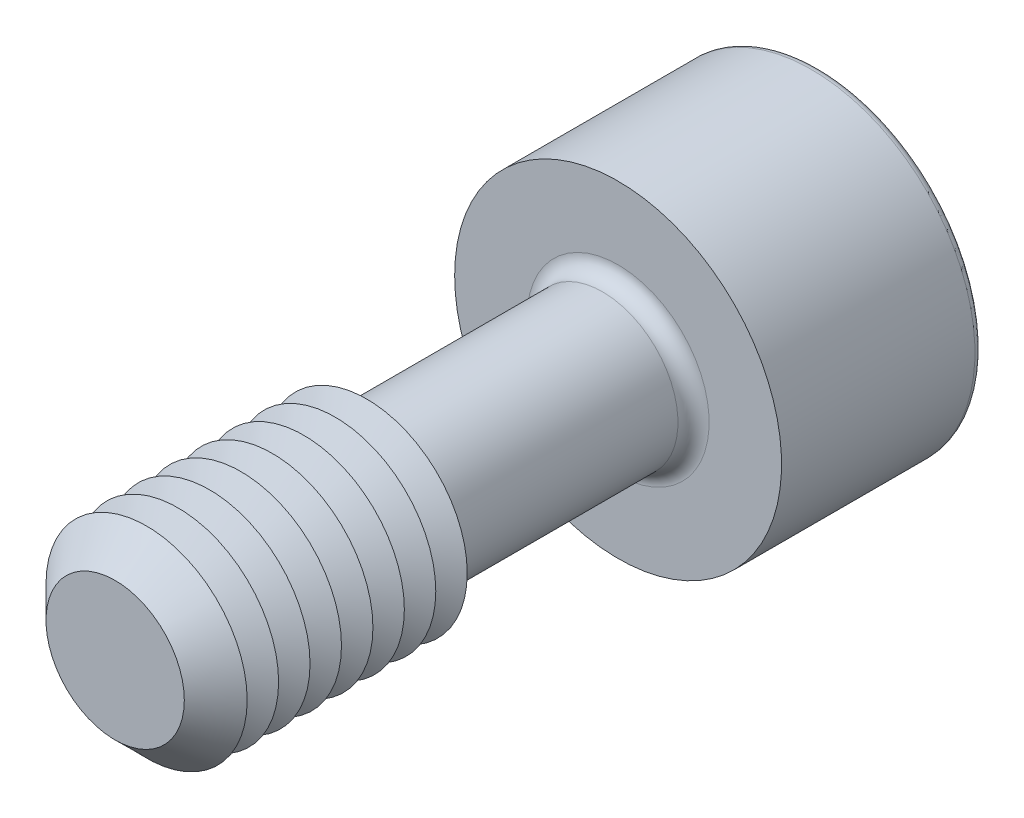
ISO-10303-21;
HEADER;
FILE_DESCRIPTION(('STEP AP214'),'2;1');
FILE_NAME('part.step','',(''),(''),'','','');
FILE_SCHEMA(('AUTOMOTIVE_DESIGN { 1 0 10303 214 1 1 1 1 }'));
ENDSEC;
DATA;
#1=APPLICATION_CONTEXT('core data for automotive mechanical design processes');
#2=APPLICATION_PROTOCOL_DEFINITION('international standard','automotive_design',2000,#1);
#3=PRODUCT_CONTEXT('',#1,'mechanical');
#4=PRODUCT('Part','Part','',(#3));
#5=PRODUCT_RELATED_PRODUCT_CATEGORY('part','',(#4));
#6=PRODUCT_DEFINITION_FORMATION('','',#4);
#7=PRODUCT_DEFINITION_CONTEXT('part definition',#1,'design');
#8=PRODUCT_DEFINITION('design','',#6,#7);
#9=PRODUCT_DEFINITION_SHAPE('','',#8);
#10=(LENGTH_UNIT() NAMED_UNIT(*) SI_UNIT(.MILLI.,.METRE.));
#11=(NAMED_UNIT(*) PLANE_ANGLE_UNIT() SI_UNIT($,.RADIAN.));
#12=(NAMED_UNIT(*) SI_UNIT($,.STERADIAN.) SOLID_ANGLE_UNIT());
#13=UNCERTAINTY_MEASURE_WITH_UNIT(LENGTH_MEASURE(1.E-05),#10,'distance_accuracy_value','');
#14=(GEOMETRIC_REPRESENTATION_CONTEXT(3) GLOBAL_UNCERTAINTY_ASSIGNED_CONTEXT((#13)) GLOBAL_UNIT_ASSIGNED_CONTEXT((#10,
#11,#12)) REPRESENTATION_CONTEXT('',''));
#15=CARTESIAN_POINT('',(0.,0.,0.));
#16=DIRECTION('',(0.,0.,1.));
#17=DIRECTION('',(1.,0.,0.));
#18=AXIS2_PLACEMENT_3D('',#15,#16,#17);
#19=CARTESIAN_POINT('',(-1.73205080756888,-3.,-12.));
#20=DIRECTION('',(0.,0.,1.));
#21=DIRECTION('',(1.,0.,0.));
#22=AXIS2_PLACEMENT_3D('',#19,#20,#21);
#23=PLANE('',#22);
#24=DIRECTION('',(1.,0.,0.));
#25=VECTOR('',#24,1.);
#26=CARTESIAN_POINT('',(-1.73205080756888,-3.,-12.));
#27=LINE('',#26,#25);
#28=CARTESIAN_POINT('',(0.,-3.,-12.));
#29=VERTEX_POINT('',#28);
#30=CARTESIAN_POINT('',(1.73205080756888,-3.,-12.));
#31=VERTEX_POINT('',#30);
#32=EDGE_CURVE('E405',#29,#31,#27,.T.);
#33=ORIENTED_EDGE('',*,*,#32,.F.);
#34=CARTESIAN_POINT('',(0.,0.,-12.));
#35=DIRECTION('',(0.,0.,1.));
#36=DIRECTION('',(0.,-1.,0.));
#37=AXIS2_PLACEMENT_3D('',#34,#35,#36);
#38=CIRCLE('',#37,3.);
#39=CARTESIAN_POINT('',(2.59807621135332,-1.5,-12.));
#40=VERTEX_POINT('',#39);
#41=EDGE_CURVE('E53',#29,#40,#38,.T.);
#42=ORIENTED_EDGE('',*,*,#41,.T.);
#43=DIRECTION('',(0.5,0.866025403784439,0.));
#44=VECTOR('',#43,1.);
#45=CARTESIAN_POINT('',(1.73205080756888,-3.,-12.));
#46=LINE('',#45,#44);
#47=EDGE_CURVE('E395',#31,#40,#46,.T.);
#48=ORIENTED_EDGE('',*,*,#47,.F.);
#49=EDGE_LOOP('',(#33,#42,#48));
#50=FACE_BOUND('',#49,.T.);
#51=ADVANCED_FACE('F41',(#50),#23,.F.);
#52=CARTESIAN_POINT('',(3.46410161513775,0.,-12.));
#53=VERTEX_POINT('',#52);
#54=EDGE_CURVE('E399',#40,#53,#46,.T.);
#55=ORIENTED_EDGE('',*,*,#54,.F.);
#56=CARTESIAN_POINT('',(2.59807621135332,1.5,-12.));
#57=VERTEX_POINT('',#56);
#58=EDGE_CURVE('E11',#40,#57,#38,.T.);
#59=ORIENTED_EDGE('',*,*,#58,.T.);
#60=DIRECTION('',(-0.5,0.866025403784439,0.));
#61=VECTOR('',#60,1.);
#62=CARTESIAN_POINT('',(3.46410161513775,0.,-12.));
#63=LINE('',#62,#61);
#64=EDGE_CURVE('E391',#53,#57,#63,.T.);
#65=ORIENTED_EDGE('',*,*,#64,.F.);
#66=EDGE_LOOP('',(#55,#59,#65));
#67=FACE_BOUND('',#66,.T.);
#68=ADVANCED_FACE('F133',(#67),#23,.F.);
#69=CARTESIAN_POINT('',(1.73205080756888,3.,-12.));
#70=VERTEX_POINT('',#69);
#71=EDGE_CURVE('E390',#57,#70,#63,.T.);
#72=ORIENTED_EDGE('',*,*,#71,.F.);
#73=CARTESIAN_POINT('',(0.,3.,-12.));
#74=VERTEX_POINT('',#73);
#75=EDGE_CURVE('E51',#57,#74,#38,.T.);
#76=ORIENTED_EDGE('',*,*,#75,.T.);
#77=DIRECTION('',(-1.,0.,0.));
#78=VECTOR('',#77,1.);
#79=CARTESIAN_POINT('',(1.73205080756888,3.,-12.));
#80=LINE('',#79,#78);
#81=EDGE_CURVE('E177',#70,#74,#80,.T.);
#82=ORIENTED_EDGE('',*,*,#81,.F.);
#83=EDGE_LOOP('',(#72,#76,#82));
#84=FACE_BOUND('',#83,.T.);
#85=ADVANCED_FACE('F139',(#84),#23,.F.);
#86=CARTESIAN_POINT('',(-1.73205080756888,3.,-12.));
#87=VERTEX_POINT('',#86);
#88=EDGE_CURVE('E397',#74,#87,#80,.T.);
#89=ORIENTED_EDGE('',*,*,#88,.F.);
#90=CARTESIAN_POINT('',(-2.59807621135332,1.5,-12.));
#91=VERTEX_POINT('',#90);
#92=EDGE_CURVE('E266',#74,#91,#38,.T.);
#93=ORIENTED_EDGE('',*,*,#92,.T.);
#94=DIRECTION('',(-0.5,-0.866025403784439,0.));
#95=VECTOR('',#94,1.);
#96=CARTESIAN_POINT('',(-1.73205080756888,3.,-12.));
#97=LINE('',#96,#95);
#98=EDGE_CURVE('E176',#87,#91,#97,.T.);
#99=ORIENTED_EDGE('',*,*,#98,.F.);
#100=EDGE_LOOP('',(#89,#93,#99));
#101=FACE_BOUND('',#100,.T.);
#102=ADVANCED_FACE('F157',(#101),#23,.F.);
#103=CARTESIAN_POINT('',(-3.46410161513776,0.,-12.));
#104=VERTEX_POINT('',#103);
#105=EDGE_CURVE('E170',#91,#104,#97,.T.);
#106=ORIENTED_EDGE('',*,*,#105,.F.);
#107=CARTESIAN_POINT('',(-2.59807621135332,-1.5,-12.));
#108=VERTEX_POINT('',#107);
#109=EDGE_CURVE('E172',#91,#108,#38,.T.);
#110=ORIENTED_EDGE('',*,*,#109,.T.);
#111=DIRECTION('',(0.5,-0.866025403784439,0.));
#112=VECTOR('',#111,1.);
#113=CARTESIAN_POINT('',(-3.46410161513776,0.,-12.));
#114=LINE('',#113,#112);
#115=EDGE_CURVE('E174',#104,#108,#114,.T.);
#116=ORIENTED_EDGE('',*,*,#115,.F.);
#117=EDGE_LOOP('',(#106,#110,#116));
#118=FACE_BOUND('',#117,.T.);
#119=ADVANCED_FACE('F146',(#118),#23,.F.);
#120=CARTESIAN_POINT('',(0.,0.,-18.));
#121=DIRECTION('',(0.,0.,-1.));
#122=DIRECTION('',(-1.,0.,0.));
#123=AXIS2_PLACEMENT_3D('',#120,#121,#122);
#124=PLANE('',#123);
#125=CARTESIAN_POINT('',(0.,0.,-18.));
#126=DIRECTION('',(0.,0.,-1.));
#127=DIRECTION('',(-1.,0.,0.));
#128=AXIS2_PLACEMENT_3D('',#125,#126,#127);
#129=CIRCLE('',#128,6.19);
#130=CARTESIAN_POINT('',(-6.19,0.,-18.));
#131=VERTEX_POINT('',#130);
#132=EDGE_CURVE('E250',#131,#131,#129,.T.);
#133=ORIENTED_EDGE('',*,*,#132,.T.);
#134=EDGE_LOOP('',(#133));
#135=FACE_BOUND('',#134,.T.);
#136=DIRECTION('',(-0.5,-0.866025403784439,0.));
#137=VECTOR('',#136,1.);
#138=CARTESIAN_POINT('',(-1.73205080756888,3.,-18.));
#139=LINE('',#138,#137);
#140=CARTESIAN_POINT('',(-1.73205080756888,3.,-18.));
#141=VERTEX_POINT('',#140);
#142=CARTESIAN_POINT('',(-3.46410161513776,0.,-18.));
#143=VERTEX_POINT('',#142);
#144=EDGE_CURVE('E212',#141,#143,#139,.T.);
#145=ORIENTED_EDGE('',*,*,#144,.T.);
#146=DIRECTION('',(0.5,-0.866025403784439,0.));
#147=VECTOR('',#146,1.);
#148=CARTESIAN_POINT('',(-3.46410161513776,0.,-18.));
#149=LINE('',#148,#147);
#150=CARTESIAN_POINT('',(-1.73205080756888,-3.,-18.));
#151=VERTEX_POINT('',#150);
#152=EDGE_CURVE('E67',#143,#151,#149,.T.);
#153=ORIENTED_EDGE('',*,*,#152,.T.);
#154=DIRECTION('',(1.,0.,0.));
#155=VECTOR('',#154,1.);
#156=CARTESIAN_POINT('',(-1.73205080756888,-3.,-18.));
#157=LINE('',#156,#155);
#158=CARTESIAN_POINT('',(1.73205080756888,-3.,-18.));
#159=VERTEX_POINT('',#158);
#160=EDGE_CURVE('E196',#151,#159,#157,.T.);
#161=ORIENTED_EDGE('',*,*,#160,.T.);
#162=DIRECTION('',(0.5,0.866025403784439,0.));
#163=VECTOR('',#162,1.);
#164=CARTESIAN_POINT('',(1.73205080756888,-3.,-18.));
#165=LINE('',#164,#163);
#166=CARTESIAN_POINT('',(3.46410161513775,0.,-18.));
#167=VERTEX_POINT('',#166);
#168=EDGE_CURVE('E200',#159,#167,#165,.T.);
#169=ORIENTED_EDGE('',*,*,#168,.T.);
#170=DIRECTION('',(-0.5,0.866025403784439,0.));
#171=VECTOR('',#170,1.);
#172=CARTESIAN_POINT('',(3.46410161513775,0.,-18.));
#173=LINE('',#172,#171);
#174=CARTESIAN_POINT('',(1.73205080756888,3.,-18.));
#175=VERTEX_POINT('',#174);
#176=EDGE_CURVE('E204',#167,#175,#173,.T.);
#177=ORIENTED_EDGE('',*,*,#176,.T.);
#178=DIRECTION('',(-1.,0.,0.));
#179=VECTOR('',#178,1.);
#180=CARTESIAN_POINT('',(1.73205080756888,3.,-18.));
#181=LINE('',#180,#179);
#182=EDGE_CURVE('E208',#175,#141,#181,.T.);
#183=ORIENTED_EDGE('',*,*,#182,.T.);
#184=EDGE_LOOP('',(#145,#153,#161,#169,#177,#183));
#185=FACE_BOUND('',#184,.T.);
#186=ADVANCED_FACE('F156',(#135,#185),#124,.T.);
#187=CARTESIAN_POINT('',(0.,0.,10.));
#188=DIRECTION('',(0.,0.,-1.));
#189=DIRECTION('',(-1.,0.,0.));
#190=AXIS2_PLACEMENT_3D('',#187,#188,#189);
#191=CYLINDRICAL_SURFACE('',#190,3.);
#192=CARTESIAN_POINT('',(0.,0.,-9.38));
#193=DIRECTION('',(0.,0.,-1.));
#194=DIRECTION('',(-1.,0.,0.));
#195=AXIS2_PLACEMENT_3D('',#192,#193,#194);
#196=CIRCLE('',#195,3.);
#197=CARTESIAN_POINT('',(-3.,0.,-9.38));
#198=VERTEX_POINT('',#197);
#199=EDGE_CURVE('E247',#198,#198,#196,.F.);
#200=ORIENTED_EDGE('',*,*,#199,.T.);
#201=EDGE_LOOP('',(#200));
#202=FACE_BOUND('',#201,.T.);
#203=CARTESIAN_POINT('',(0.,0.,-0.577350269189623));
#204=DIRECTION('',(0.,0.,-1.));
#205=DIRECTION('',(0.,1.,0.));
#206=AXIS2_PLACEMENT_3D('',#203,#204,#205);
#207=CIRCLE('',#206,3.);
#208=CARTESIAN_POINT('',(0.,3.,-0.577350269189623));
#209=VERTEX_POINT('',#208);
#210=EDGE_CURVE('E235',#209,#209,#207,.T.);
#211=ORIENTED_EDGE('',*,*,#210,.T.);
#212=EDGE_LOOP('',(#211));
#213=FACE_BOUND('',#212,.T.);
#214=ADVANCED_FACE('F163',(#202,#213),#191,.T.);
#215=CARTESIAN_POINT('',(0.,0.,-0.577350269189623));
#216=DIRECTION('',(0.,0.,1.));
#217=DIRECTION('',(0.,-1.,0.));
#218=AXIS2_PLACEMENT_3D('',#215,#216,#217);
#219=CONICAL_SURFACE('',#218,3.,1.0471975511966);
#220=CARTESIAN_POINT('',(0.,0.,0.));
#221=DIRECTION('',(0.,0.,-1.));
#222=DIRECTION('',(-1.,0.,0.));
#223=AXIS2_PLACEMENT_3D('',#220,#221,#222);
#224=CIRCLE('',#223,4.);
#225=CARTESIAN_POINT('',(-4.,0.,0.));
#226=VERTEX_POINT('',#225);
#227=EDGE_CURVE('E270',#226,#226,#224,.T.);
#228=ORIENTED_EDGE('',*,*,#227,.T.);
#229=EDGE_LOOP('',(#228));
#230=FACE_BOUND('',#229,.T.);
#231=ORIENTED_EDGE('',*,*,#210,.F.);
#232=EDGE_LOOP('',(#231));
#233=FACE_BOUND('',#232,.T.);
#234=ADVANCED_FACE('F348',(#230,#233),#219,.T.);
#235=CARTESIAN_POINT('',(0.,0.,-10.));
#236=DIRECTION('',(0.,0.,-1.));
#237=DIRECTION('',(-1.,0.,0.));
#238=AXIS2_PLACEMENT_3D('',#235,#236,#237);
#239=PLANE('',#238);
#240=CARTESIAN_POINT('',(0.,0.,-10.));
#241=DIRECTION('',(0.,0.,-1.));
#242=DIRECTION('',(-1.,0.,0.));
#243=AXIS2_PLACEMENT_3D('',#240,#241,#242);
#244=CIRCLE('',#243,3.62);
#245=CARTESIAN_POINT('',(-3.62,0.,-10.));
#246=VERTEX_POINT('',#245);
#247=EDGE_CURVE('E243',#246,#246,#244,.T.);
#248=ORIENTED_EDGE('',*,*,#247,.T.);
#249=EDGE_LOOP('',(#248));
#250=FACE_BOUND('',#249,.T.);
#251=CARTESIAN_POINT('',(0.,0.,-10.));
#252=DIRECTION('',(0.,0.,-1.));
#253=DIRECTION('',(-1.,0.,0.));
#254=AXIS2_PLACEMENT_3D('',#251,#252,#253);
#255=CIRCLE('',#254,6.5);
#256=CARTESIAN_POINT('',(-6.5,0.,-10.));
#257=VERTEX_POINT('',#256);
#258=EDGE_CURVE('E231',#257,#257,#255,.T.);
#259=ORIENTED_EDGE('',*,*,#258,.F.);
#260=EDGE_LOOP('',(#259));
#261=FACE_BOUND('',#260,.T.);
#262=ADVANCED_FACE('F353',(#250,#261),#239,.F.);
#263=CARTESIAN_POINT('',(0.,0.,-18.));
#264=DIRECTION('',(0.,0.,1.));
#265=DIRECTION('',(1.,0.,0.));
#266=AXIS2_PLACEMENT_3D('',#263,#264,#265);
#267=CYLINDRICAL_SURFACE('',#266,6.5);
#268=CARTESIAN_POINT('',(0.,0.,-17.69));
#269=DIRECTION('',(0.,0.,-1.));
#270=DIRECTION('',(-1.,0.,0.));
#271=AXIS2_PLACEMENT_3D('',#268,#269,#270);
#272=CIRCLE('',#271,6.5);
#273=CARTESIAN_POINT('',(-6.5,0.,-17.69));
#274=VERTEX_POINT('',#273);
#275=EDGE_CURVE('E45',#274,#274,#272,.F.);
#276=ORIENTED_EDGE('',*,*,#275,.T.);
#277=EDGE_LOOP('',(#276));
#278=FACE_BOUND('',#277,.T.);
#279=ORIENTED_EDGE('',*,*,#258,.T.);
#280=EDGE_LOOP('',(#279));
#281=FACE_BOUND('',#280,.T.);
#282=ADVANCED_FACE('F354',(#278,#281),#267,.T.);
#283=CARTESIAN_POINT('',(-3.46410161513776,0.,-12.));
#284=DIRECTION('',(0.866025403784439,0.5,0.));
#285=DIRECTION('',(-0.5,0.866025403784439,0.));
#286=AXIS2_PLACEMENT_3D('',#283,#284,#285);
#287=PLANE('',#286);
#288=ORIENTED_EDGE('',*,*,#152,.F.);
#289=DIRECTION('',(0.,0.,-1.));
#290=VECTOR('',#289,1.);
#291=CARTESIAN_POINT('',(-3.46410161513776,0.,-12.));
#292=LINE('',#291,#290);
#293=EDGE_CURVE('E186',#104,#143,#292,.T.);
#294=ORIENTED_EDGE('',*,*,#293,.F.);
#295=ORIENTED_EDGE('',*,*,#115,.T.);
#296=CARTESIAN_POINT('',(-1.73205080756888,-3.,-12.));
#297=VERTEX_POINT('',#296);
#298=EDGE_CURVE('E215',#108,#297,#114,.T.);
#299=ORIENTED_EDGE('',*,*,#298,.T.);
#300=DIRECTION('',(0.,0.,-1.));
#301=VECTOR('',#300,1.);
#302=CARTESIAN_POINT('',(-1.73205080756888,-3.,-12.));
#303=LINE('',#302,#301);
#304=EDGE_CURVE('E228',#297,#151,#303,.T.);
#305=ORIENTED_EDGE('',*,*,#304,.T.);
#306=EDGE_LOOP('',(#288,#294,#295,#299,#305));
#307=FACE_BOUND('',#306,.T.);
#308=ADVANCED_FACE('F357',(#307),#287,.T.);
#309=CARTESIAN_POINT('',(-1.73205080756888,-3.,-12.));
#310=DIRECTION('',(0.,1.,0.));
#311=DIRECTION('',(0.,0.,1.));
#312=AXIS2_PLACEMENT_3D('',#309,#310,#311);
#313=PLANE('',#312);
#314=ORIENTED_EDGE('',*,*,#160,.F.);
#315=ORIENTED_EDGE('',*,*,#304,.F.);
#316=EDGE_CURVE('E402',#297,#29,#27,.T.);
#317=ORIENTED_EDGE('',*,*,#316,.T.);
#318=ORIENTED_EDGE('',*,*,#32,.T.);
#319=DIRECTION('',(0.,0.,-1.));
#320=VECTOR('',#319,1.);
#321=CARTESIAN_POINT('',(1.73205080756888,-3.,-12.));
#322=LINE('',#321,#320);
#323=EDGE_CURVE('E225',#31,#159,#322,.T.);
#324=ORIENTED_EDGE('',*,*,#323,.T.);
#325=EDGE_LOOP('',(#314,#315,#317,#318,#324));
#326=FACE_BOUND('',#325,.T.);
#327=ADVANCED_FACE('F363',(#326),#313,.T.);
#328=CARTESIAN_POINT('',(1.73205080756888,-3.,-12.));
#329=DIRECTION('',(-0.866025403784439,0.5,0.));
#330=DIRECTION('',(-0.5,-0.866025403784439,0.));
#331=AXIS2_PLACEMENT_3D('',#328,#329,#330);
#332=PLANE('',#331);
#333=ORIENTED_EDGE('',*,*,#168,.F.);
#334=ORIENTED_EDGE('',*,*,#323,.F.);
#335=ORIENTED_EDGE('',*,*,#47,.T.);
#336=ORIENTED_EDGE('',*,*,#54,.T.);
#337=DIRECTION('',(0.,0.,-1.));
#338=VECTOR('',#337,1.);
#339=CARTESIAN_POINT('',(3.46410161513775,0.,-12.));
#340=LINE('',#339,#338);
#341=EDGE_CURVE('E222',#53,#167,#340,.T.);
#342=ORIENTED_EDGE('',*,*,#341,.T.);
#343=EDGE_LOOP('',(#333,#334,#335,#336,#342));
#344=FACE_BOUND('',#343,.T.);
#345=ADVANCED_FACE('F366',(#344),#332,.T.);
#346=CARTESIAN_POINT('',(3.46410161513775,0.,-12.));
#347=DIRECTION('',(-0.866025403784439,-0.5,0.));
#348=DIRECTION('',(0.5,-0.866025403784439,0.));
#349=AXIS2_PLACEMENT_3D('',#346,#347,#348);
#350=PLANE('',#349);
#351=ORIENTED_EDGE('',*,*,#176,.F.);
#352=ORIENTED_EDGE('',*,*,#341,.F.);
#353=ORIENTED_EDGE('',*,*,#64,.T.);
#354=ORIENTED_EDGE('',*,*,#71,.T.);
#355=DIRECTION('',(0.,0.,-1.));
#356=VECTOR('',#355,1.);
#357=CARTESIAN_POINT('',(1.73205080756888,3.,-12.));
#358=LINE('',#357,#356);
#359=EDGE_CURVE('E219',#70,#175,#358,.T.);
#360=ORIENTED_EDGE('',*,*,#359,.T.);
#361=EDGE_LOOP('',(#351,#352,#353,#354,#360));
#362=FACE_BOUND('',#361,.T.);
#363=ADVANCED_FACE('F370',(#362),#350,.T.);
#364=CARTESIAN_POINT('',(1.73205080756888,3.,-12.));
#365=DIRECTION('',(0.,-1.,0.));
#366=DIRECTION('',(1.,0.,0.));
#367=AXIS2_PLACEMENT_3D('',#364,#365,#366);
#368=PLANE('',#367);
#369=ORIENTED_EDGE('',*,*,#182,.F.);
#370=ORIENTED_EDGE('',*,*,#359,.F.);
#371=ORIENTED_EDGE('',*,*,#81,.T.);
#372=ORIENTED_EDGE('',*,*,#88,.T.);
#373=DIRECTION('',(0.,0.,-1.));
#374=VECTOR('',#373,1.);
#375=CARTESIAN_POINT('',(-1.73205080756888,3.,-12.));
#376=LINE('',#375,#374);
#377=EDGE_CURVE('E182',#87,#141,#376,.T.);
#378=ORIENTED_EDGE('',*,*,#377,.T.);
#379=EDGE_LOOP('',(#369,#370,#371,#372,#378));
#380=FACE_BOUND('',#379,.T.);
#381=ADVANCED_FACE('F152',(#380),#368,.T.);
#382=CARTESIAN_POINT('',(-1.73205080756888,3.,-12.));
#383=DIRECTION('',(0.866025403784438,-0.5,0.));
#384=DIRECTION('',(0.5,0.866025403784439,0.));
#385=AXIS2_PLACEMENT_3D('',#382,#383,#384);
#386=PLANE('',#385);
#387=ORIENTED_EDGE('',*,*,#144,.F.);
#388=ORIENTED_EDGE('',*,*,#377,.F.);
#389=ORIENTED_EDGE('',*,*,#98,.T.);
#390=ORIENTED_EDGE('',*,*,#105,.T.);
#391=ORIENTED_EDGE('',*,*,#293,.T.);
#392=EDGE_LOOP('',(#387,#388,#389,#390,#391));
#393=FACE_BOUND('',#392,.T.);
#394=ADVANCED_FACE('F144',(#393),#386,.T.);
#395=ORIENTED_EDGE('',*,*,#298,.F.);
#396=EDGE_CURVE('E258',#108,#29,#38,.T.);
#397=ORIENTED_EDGE('',*,*,#396,.T.);
#398=ORIENTED_EDGE('',*,*,#316,.F.);
#399=EDGE_LOOP('',(#395,#397,#398));
#400=FACE_BOUND('',#399,.T.);
#401=ADVANCED_FACE('F135',(#400),#23,.F.);
#402=CARTESIAN_POINT('',(0.,0.,-9.38));
#403=DIRECTION('',(0.,0.,-1.));
#404=DIRECTION('',(-1.,0.,0.));
#405=AXIS2_PLACEMENT_3D('',#402,#403,#404);
#406=TOROIDAL_SURFACE('',#405,3.62,0.62);
#407=ORIENTED_EDGE('',*,*,#199,.F.);
#408=EDGE_LOOP('',(#407));
#409=FACE_BOUND('',#408,.T.);
#410=ORIENTED_EDGE('',*,*,#247,.F.);
#411=EDGE_LOOP('',(#410));
#412=FACE_BOUND('',#411,.T.);
#413=ADVANCED_FACE('F129',(#409,#412),#406,.F.);
#414=CARTESIAN_POINT('',(0.,0.,-17.69));
#415=DIRECTION('',(0.,0.,-1.));
#416=DIRECTION('',(-1.,0.,0.));
#417=AXIS2_PLACEMENT_3D('',#414,#415,#416);
#418=TOROIDAL_SURFACE('',#417,6.19,0.31);
#419=ORIENTED_EDGE('',*,*,#275,.F.);
#420=EDGE_LOOP('',(#419));
#421=FACE_BOUND('',#420,.T.);
#422=ORIENTED_EDGE('',*,*,#132,.F.);
#423=EDGE_LOOP('',(#422));
#424=FACE_BOUND('',#423,.T.);
#425=ADVANCED_FACE('F43',(#421,#424),#418,.T.);
#426=CARTESIAN_POINT('',(0.,0.,-10.2679491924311));
#427=DIRECTION('',(0.,0.,-1.));
#428=DIRECTION('',(0.,1.,0.));
#429=AXIS2_PLACEMENT_3D('',#426,#427,#428);
#430=CONICAL_SURFACE('',#429,0.,1.0471975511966);
#431=ORIENTED_EDGE('',*,*,#41,.F.);
#432=ORIENTED_EDGE('',*,*,#396,.F.);
#433=ORIENTED_EDGE('',*,*,#109,.F.);
#434=ORIENTED_EDGE('',*,*,#92,.F.);
#435=ORIENTED_EDGE('',*,*,#75,.F.);
#436=ORIENTED_EDGE('',*,*,#58,.F.);
#437=EDGE_LOOP('',(#431,#432,#433,#434,#435,#436));
#438=FACE_BOUND('',#437,.T.);
#439=CARTESIAN_POINT('',(0.,0.,-10.2679491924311));
#440=VERTEX_POINT('',#439);
#441=VERTEX_LOOP('',#440);
#442=FACE_BOUND('',#441,.T.);
#443=ADVANCED_FACE('F118',(#438,#442),#430,.F.);
#444=CARTESIAN_POINT('',(0.,0.,0.625000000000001));
#445=DIRECTION('',(0.,0.,-1.));
#446=DIRECTION('',(-1.,0.,0.));
#447=AXIS2_PLACEMENT_3D('',#444,#445,#446);
#448=CONICAL_SURFACE('',#447,2.91746824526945,1.0471975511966);
#449=ORIENTED_EDGE('',*,*,#227,.F.);
#450=EDGE_LOOP('',(#449));
#451=FACE_BOUND('',#450,.T.);
#452=CARTESIAN_POINT('',(0.,0.,0.625000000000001));
#453=DIRECTION('',(0.,0.,-1.));
#454=DIRECTION('',(-1.,0.,0.));
#455=AXIS2_PLACEMENT_3D('',#452,#453,#454);
#456=CIRCLE('',#455,2.91746824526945);
#457=CARTESIAN_POINT('',(-2.91746824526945,0.,0.625000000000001));
#458=VERTEX_POINT('',#457);
#459=EDGE_CURVE('E276',#458,#458,#456,.T.);
#460=ORIENTED_EDGE('',*,*,#459,.T.);
#461=EDGE_LOOP('',(#460));
#462=FACE_BOUND('',#461,.T.);
#463=ADVANCED_FACE('F120',(#451,#462),#448,.T.);
#464=CARTESIAN_POINT('',(0.,0.,1.25));
#465=DIRECTION('',(0.,0.,1.));
#466=DIRECTION('',(1.,0.,0.));
#467=AXIS2_PLACEMENT_3D('',#464,#465,#466);
#468=CONICAL_SURFACE('',#467,4.,1.0471975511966);
#469=ORIENTED_EDGE('',*,*,#459,.F.);
#470=EDGE_LOOP('',(#469));
#471=FACE_BOUND('',#470,.T.);
#472=CARTESIAN_POINT('',(0.,0.,1.25));
#473=DIRECTION('',(0.,0.,-1.));
#474=DIRECTION('',(-1.,0.,0.));
#475=AXIS2_PLACEMENT_3D('',#472,#473,#474);
#476=CIRCLE('',#475,4.);
#477=CARTESIAN_POINT('',(-4.,0.,1.25));
#478=VERTEX_POINT('',#477);
#479=EDGE_CURVE('E281',#478,#478,#476,.T.);
#480=ORIENTED_EDGE('',*,*,#479,.T.);
#481=EDGE_LOOP('',(#480));
#482=FACE_BOUND('',#481,.T.);
#483=ADVANCED_FACE('F126',(#471,#482),#468,.T.);
#484=CARTESIAN_POINT('',(0.,0.,1.875));
#485=DIRECTION('',(0.,0.,-1.));
#486=DIRECTION('',(-1.,0.,0.));
#487=AXIS2_PLACEMENT_3D('',#484,#485,#486);
#488=CONICAL_SURFACE('',#487,2.91746824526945,1.0471975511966);
#489=ORIENTED_EDGE('',*,*,#479,.F.);
#490=EDGE_LOOP('',(#489));
#491=FACE_BOUND('',#490,.T.);
#492=CARTESIAN_POINT('',(0.,0.,1.875));
#493=DIRECTION('',(0.,0.,-1.));
#494=DIRECTION('',(-1.,0.,0.));
#495=AXIS2_PLACEMENT_3D('',#492,#493,#494);
#496=CIRCLE('',#495,2.91746824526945);
#497=CARTESIAN_POINT('',(-2.91746824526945,0.,1.875));
#498=VERTEX_POINT('',#497);
#499=EDGE_CURVE('E287',#498,#498,#496,.T.);
#500=ORIENTED_EDGE('',*,*,#499,.T.);
#501=EDGE_LOOP('',(#500));
#502=FACE_BOUND('',#501,.T.);
#503=ADVANCED_FACE('F508',(#491,#502),#488,.T.);
#504=CARTESIAN_POINT('',(0.,0.,2.5));
#505=DIRECTION('',(0.,0.,1.));
#506=DIRECTION('',(1.,0.,0.));
#507=AXIS2_PLACEMENT_3D('',#504,#505,#506);
#508=CONICAL_SURFACE('',#507,4.,1.0471975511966);
#509=ORIENTED_EDGE('',*,*,#499,.F.);
#510=EDGE_LOOP('',(#509));
#511=FACE_BOUND('',#510,.T.);
#512=CARTESIAN_POINT('',(0.,0.,2.5));
#513=DIRECTION('',(0.,0.,-1.));
#514=DIRECTION('',(-1.,0.,0.));
#515=AXIS2_PLACEMENT_3D('',#512,#513,#514);
#516=CIRCLE('',#515,4.);
#517=CARTESIAN_POINT('',(-4.,0.,2.5));
#518=VERTEX_POINT('',#517);
#519=EDGE_CURVE('E291',#518,#518,#516,.T.);
#520=ORIENTED_EDGE('',*,*,#519,.T.);
#521=EDGE_LOOP('',(#520));
#522=FACE_BOUND('',#521,.T.);
#523=ADVANCED_FACE('F517',(#511,#522),#508,.T.);
#524=CARTESIAN_POINT('',(0.,0.,3.125));
#525=DIRECTION('',(0.,0.,-1.));
#526=DIRECTION('',(-1.,0.,0.));
#527=AXIS2_PLACEMENT_3D('',#524,#525,#526);
#528=CONICAL_SURFACE('',#527,2.91746824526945,1.0471975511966);
#529=ORIENTED_EDGE('',*,*,#519,.F.);
#530=EDGE_LOOP('',(#529));
#531=FACE_BOUND('',#530,.T.);
#532=CARTESIAN_POINT('',(0.,0.,3.125));
#533=DIRECTION('',(0.,0.,-1.));
#534=DIRECTION('',(-1.,0.,0.));
#535=AXIS2_PLACEMENT_3D('',#532,#533,#534);
#536=CIRCLE('',#535,2.91746824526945);
#537=CARTESIAN_POINT('',(-2.91746824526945,0.,3.125));
#538=VERTEX_POINT('',#537);
#539=EDGE_CURVE('E294',#538,#538,#536,.T.);
#540=ORIENTED_EDGE('',*,*,#539,.T.);
#541=EDGE_LOOP('',(#540));
#542=FACE_BOUND('',#541,.T.);
#543=ADVANCED_FACE('F526',(#531,#542),#528,.T.);
#544=CARTESIAN_POINT('',(0.,0.,3.75));
#545=DIRECTION('',(0.,0.,1.));
#546=DIRECTION('',(1.,0.,0.));
#547=AXIS2_PLACEMENT_3D('',#544,#545,#546);
#548=CONICAL_SURFACE('',#547,4.,1.0471975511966);
#549=ORIENTED_EDGE('',*,*,#539,.F.);
#550=EDGE_LOOP('',(#549));
#551=FACE_BOUND('',#550,.T.);
#552=CARTESIAN_POINT('',(0.,0.,3.75));
#553=DIRECTION('',(0.,0.,-1.));
#554=DIRECTION('',(-1.,0.,0.));
#555=AXIS2_PLACEMENT_3D('',#552,#553,#554);
#556=CIRCLE('',#555,4.);
#557=CARTESIAN_POINT('',(-4.,0.,3.75));
#558=VERTEX_POINT('',#557);
#559=EDGE_CURVE('E297',#558,#558,#556,.T.);
#560=ORIENTED_EDGE('',*,*,#559,.T.);
#561=EDGE_LOOP('',(#560));
#562=FACE_BOUND('',#561,.T.);
#563=ADVANCED_FACE('F535',(#551,#562),#548,.T.);
#564=CARTESIAN_POINT('',(0.,0.,4.375));
#565=DIRECTION('',(0.,0.,-1.));
#566=DIRECTION('',(-1.,0.,0.));
#567=AXIS2_PLACEMENT_3D('',#564,#565,#566);
#568=CONICAL_SURFACE('',#567,2.91746824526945,1.0471975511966);
#569=ORIENTED_EDGE('',*,*,#559,.F.);
#570=EDGE_LOOP('',(#569));
#571=FACE_BOUND('',#570,.T.);
#572=CARTESIAN_POINT('',(0.,0.,4.375));
#573=DIRECTION('',(0.,0.,-1.));
#574=DIRECTION('',(-1.,0.,0.));
#575=AXIS2_PLACEMENT_3D('',#572,#573,#574);
#576=CIRCLE('',#575,2.91746824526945);
#577=CARTESIAN_POINT('',(-2.91746824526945,0.,4.375));
#578=VERTEX_POINT('',#577);
#579=EDGE_CURVE('E301',#578,#578,#576,.T.);
#580=ORIENTED_EDGE('',*,*,#579,.T.);
#581=EDGE_LOOP('',(#580));
#582=FACE_BOUND('',#581,.T.);
#583=ADVANCED_FACE('F544',(#571,#582),#568,.T.);
#584=CARTESIAN_POINT('',(0.,0.,5.));
#585=DIRECTION('',(0.,0.,1.));
#586=DIRECTION('',(1.,0.,0.));
#587=AXIS2_PLACEMENT_3D('',#584,#585,#586);
#588=CONICAL_SURFACE('',#587,4.,1.0471975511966);
#589=ORIENTED_EDGE('',*,*,#579,.F.);
#590=EDGE_LOOP('',(#589));
#591=FACE_BOUND('',#590,.T.);
#592=CARTESIAN_POINT('',(0.,0.,5.));
#593=DIRECTION('',(0.,0.,-1.));
#594=DIRECTION('',(-1.,0.,0.));
#595=AXIS2_PLACEMENT_3D('',#592,#593,#594);
#596=CIRCLE('',#595,4.);
#597=CARTESIAN_POINT('',(-4.,0.,5.));
#598=VERTEX_POINT('',#597);
#599=EDGE_CURVE('E305',#598,#598,#596,.T.);
#600=ORIENTED_EDGE('',*,*,#599,.T.);
#601=EDGE_LOOP('',(#600));
#602=FACE_BOUND('',#601,.T.);
#603=ADVANCED_FACE('F553',(#591,#602),#588,.T.);
#604=CARTESIAN_POINT('',(0.,0.,5.625));
#605=DIRECTION('',(0.,0.,-1.));
#606=DIRECTION('',(-1.,0.,0.));
#607=AXIS2_PLACEMENT_3D('',#604,#605,#606);
#608=CONICAL_SURFACE('',#607,2.91746824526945,1.0471975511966);
#609=ORIENTED_EDGE('',*,*,#599,.F.);
#610=EDGE_LOOP('',(#609));
#611=FACE_BOUND('',#610,.T.);
#612=CARTESIAN_POINT('',(0.,0.,5.625));
#613=DIRECTION('',(0.,0.,-1.));
#614=DIRECTION('',(-1.,0.,0.));
#615=AXIS2_PLACEMENT_3D('',#612,#613,#614);
#616=CIRCLE('',#615,2.91746824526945);
#617=CARTESIAN_POINT('',(-2.91746824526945,0.,5.625));
#618=VERTEX_POINT('',#617);
#619=EDGE_CURVE('E309',#618,#618,#616,.T.);
#620=ORIENTED_EDGE('',*,*,#619,.T.);
#621=EDGE_LOOP('',(#620));
#622=FACE_BOUND('',#621,.T.);
#623=ADVANCED_FACE('F562',(#611,#622),#608,.T.);
#624=CARTESIAN_POINT('',(0.,0.,6.25));
#625=DIRECTION('',(0.,0.,1.));
#626=DIRECTION('',(1.,0.,0.));
#627=AXIS2_PLACEMENT_3D('',#624,#625,#626);
#628=CONICAL_SURFACE('',#627,4.,1.0471975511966);
#629=ORIENTED_EDGE('',*,*,#619,.F.);
#630=EDGE_LOOP('',(#629));
#631=FACE_BOUND('',#630,.T.);
#632=CARTESIAN_POINT('',(0.,0.,6.25));
#633=DIRECTION('',(0.,0.,-1.));
#634=DIRECTION('',(-1.,0.,0.));
#635=AXIS2_PLACEMENT_3D('',#632,#633,#634);
#636=CIRCLE('',#635,4.);
#637=CARTESIAN_POINT('',(-4.,0.,6.25));
#638=VERTEX_POINT('',#637);
#639=EDGE_CURVE('E313',#638,#638,#636,.T.);
#640=ORIENTED_EDGE('',*,*,#639,.T.);
#641=EDGE_LOOP('',(#640));
#642=FACE_BOUND('',#641,.T.);
#643=ADVANCED_FACE('F571',(#631,#642),#628,.T.);
#644=CARTESIAN_POINT('',(0.,0.,6.875));
#645=DIRECTION('',(0.,0.,-1.));
#646=DIRECTION('',(-1.,0.,0.));
#647=AXIS2_PLACEMENT_3D('',#644,#645,#646);
#648=CONICAL_SURFACE('',#647,2.91746824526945,1.0471975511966);
#649=ORIENTED_EDGE('',*,*,#639,.F.);
#650=EDGE_LOOP('',(#649));
#651=FACE_BOUND('',#650,.T.);
#652=CARTESIAN_POINT('',(0.,0.,6.875));
#653=DIRECTION('',(0.,0.,-1.));
#654=DIRECTION('',(-1.,0.,0.));
#655=AXIS2_PLACEMENT_3D('',#652,#653,#654);
#656=CIRCLE('',#655,2.91746824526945);
#657=CARTESIAN_POINT('',(-2.91746824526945,0.,6.875));
#658=VERTEX_POINT('',#657);
#659=EDGE_CURVE('E317',#658,#658,#656,.T.);
#660=ORIENTED_EDGE('',*,*,#659,.T.);
#661=EDGE_LOOP('',(#660));
#662=FACE_BOUND('',#661,.T.);
#663=ADVANCED_FACE('F580',(#651,#662),#648,.T.);
#664=CARTESIAN_POINT('',(0.,0.,7.5));
#665=DIRECTION('',(0.,0.,1.));
#666=DIRECTION('',(1.,0.,0.));
#667=AXIS2_PLACEMENT_3D('',#664,#665,#666);
#668=CONICAL_SURFACE('',#667,4.,1.0471975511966);
#669=ORIENTED_EDGE('',*,*,#659,.F.);
#670=EDGE_LOOP('',(#669));
#671=FACE_BOUND('',#670,.T.);
#672=CARTESIAN_POINT('',(0.,0.,7.5));
#673=DIRECTION('',(0.,0.,-1.));
#674=DIRECTION('',(-1.,0.,0.));
#675=AXIS2_PLACEMENT_3D('',#672,#673,#674);
#676=CIRCLE('',#675,4.);
#677=CARTESIAN_POINT('',(-4.,0.,7.5));
#678=VERTEX_POINT('',#677);
#679=EDGE_CURVE('E321',#678,#678,#676,.T.);
#680=ORIENTED_EDGE('',*,*,#679,.T.);
#681=EDGE_LOOP('',(#680));
#682=FACE_BOUND('',#681,.T.);
#683=ADVANCED_FACE('F589',(#671,#682),#668,.T.);
#684=CARTESIAN_POINT('',(0.,0.,8.125));
#685=DIRECTION('',(0.,0.,-1.));
#686=DIRECTION('',(-1.,0.,0.));
#687=AXIS2_PLACEMENT_3D('',#684,#685,#686);
#688=CONICAL_SURFACE('',#687,2.91746824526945,1.0471975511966);
#689=ORIENTED_EDGE('',*,*,#679,.F.);
#690=EDGE_LOOP('',(#689));
#691=FACE_BOUND('',#690,.T.);
#692=CARTESIAN_POINT('',(0.,0.,8.125));
#693=DIRECTION('',(0.,0.,-1.));
#694=DIRECTION('',(-1.,0.,0.));
#695=AXIS2_PLACEMENT_3D('',#692,#693,#694);
#696=CIRCLE('',#695,2.91746824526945);
#697=CARTESIAN_POINT('',(-2.91746824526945,0.,8.125));
#698=VERTEX_POINT('',#697);
#699=EDGE_CURVE('E325',#698,#698,#696,.T.);
#700=ORIENTED_EDGE('',*,*,#699,.T.);
#701=EDGE_LOOP('',(#700));
#702=FACE_BOUND('',#701,.T.);
#703=ADVANCED_FACE('F598',(#691,#702),#688,.T.);
#704=CARTESIAN_POINT('',(0.,0.,8.75));
#705=DIRECTION('',(0.,0.,1.));
#706=DIRECTION('',(1.,0.,0.));
#707=AXIS2_PLACEMENT_3D('',#704,#705,#706);
#708=CONICAL_SURFACE('',#707,4.,1.0471975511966);
#709=ORIENTED_EDGE('',*,*,#699,.F.);
#710=EDGE_LOOP('',(#709));
#711=FACE_BOUND('',#710,.T.);
#712=CARTESIAN_POINT('',(0.,0.,8.75));
#713=DIRECTION('',(0.,0.,-1.));
#714=DIRECTION('',(-1.,0.,0.));
#715=AXIS2_PLACEMENT_3D('',#712,#713,#714);
#716=CIRCLE('',#715,4.);
#717=CARTESIAN_POINT('',(-4.,0.,8.75));
#718=VERTEX_POINT('',#717);
#719=EDGE_CURVE('E328',#718,#718,#716,.T.);
#720=ORIENTED_EDGE('',*,*,#719,.T.);
#721=EDGE_LOOP('',(#720));
#722=FACE_BOUND('',#721,.T.);
#723=ADVANCED_FACE('F333',(#711,#722),#708,.T.);
#724=CARTESIAN_POINT('',(0.,0.,10.));
#725=DIRECTION('',(0.,0.,1.));
#726=DIRECTION('',(1.,0.,0.));
#727=AXIS2_PLACEMENT_3D('',#724,#725,#726);
#728=PLANE('',#727);
#729=CARTESIAN_POINT('',(0.,0.,10.));
#730=DIRECTION('',(0.,0.,1.));
#731=DIRECTION('',(1.,0.,0.));
#732=AXIS2_PLACEMENT_3D('',#729,#730,#731);
#733=CIRCLE('',#732,2.75000000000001);
#734=CARTESIAN_POINT('',(2.75000000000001,0.,10.));
#735=VERTEX_POINT('',#734);
#736=EDGE_CURVE('E239',#735,#735,#733,.T.);
#737=ORIENTED_EDGE('',*,*,#736,.T.);
#738=EDGE_LOOP('',(#737));
#739=FACE_BOUND('',#738,.T.);
#740=ADVANCED_FACE('F337',(#739),#728,.T.);
#741=CARTESIAN_POINT('',(0.,0.,8.75000000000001));
#742=DIRECTION('',(0.,0.,-1.));
#743=DIRECTION('',(0.,1.,0.));
#744=AXIS2_PLACEMENT_3D('',#741,#742,#743);
#745=CONICAL_SURFACE('',#744,4.,0.78539816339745);
#746=ORIENTED_EDGE('',*,*,#736,.F.);
#747=EDGE_LOOP('',(#746));
#748=FACE_BOUND('',#747,.T.);
#749=ORIENTED_EDGE('',*,*,#719,.F.);
#750=EDGE_LOOP('',(#749));
#751=FACE_BOUND('',#750,.T.);
#752=ADVANCED_FACE('F335',(#748,#751),#745,.T.);
#753=CLOSED_SHELL('',(#51,#68,#85,#102,#119,#186,#214,#234,#262,#282,#308,#327,#345,#363,#381,
#394,#401,#413,#425,#443,#463,#483,#503,#523,#543,#563,#583,#603,#623,#643,#663,#683,#703,#723,
#740,#752));
#754=MANIFOLD_SOLID_BREP('B2',#753);
#755=ADVANCED_BREP_SHAPE_REPRESENTATION('',(#18,#754),#14);
#756=SHAPE_DEFINITION_REPRESENTATION(#9,#755);
ENDSEC;
END-ISO-10303-21;
